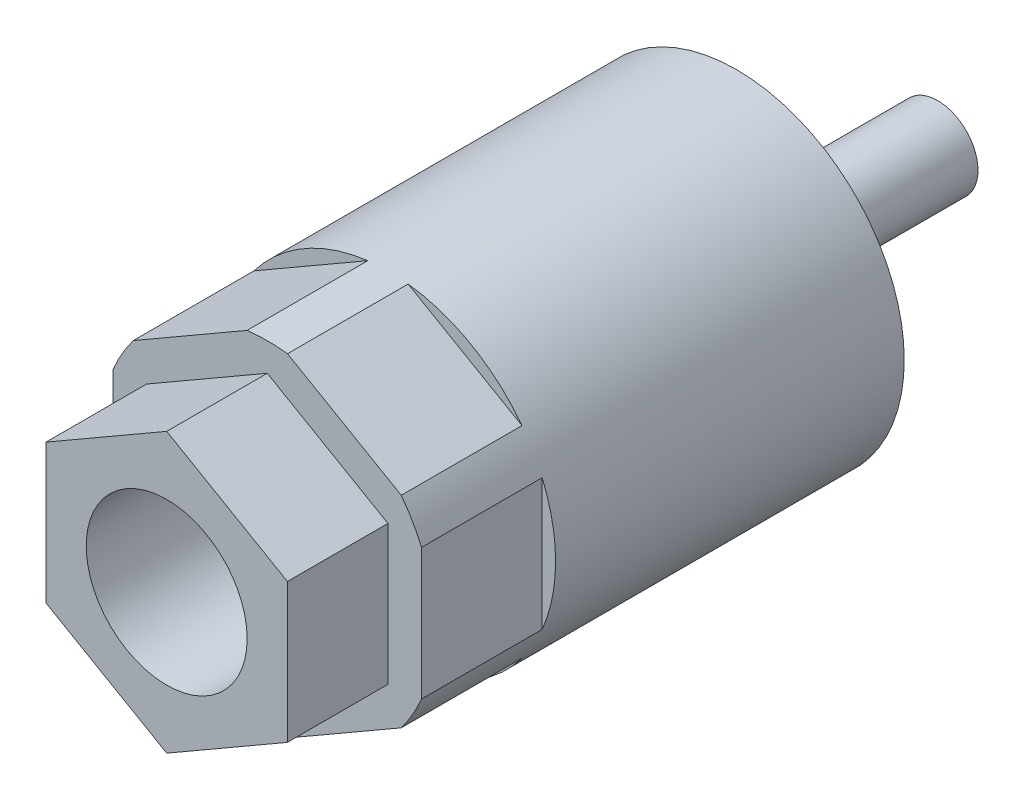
ISO-10303-21;
HEADER;
FILE_DESCRIPTION(('STEP AP214'),'2;1');
FILE_NAME('part.step','',(''),(''),'','','');
FILE_SCHEMA(('AUTOMOTIVE_DESIGN { 1 0 10303 214 1 1 1 1 }'));
ENDSEC;
DATA;
#1=APPLICATION_CONTEXT('core data for automotive mechanical design processes');
#2=APPLICATION_PROTOCOL_DEFINITION('international standard','automotive_design',2000,#1);
#3=PRODUCT_CONTEXT('',#1,'mechanical');
#4=PRODUCT('Part','Part','',(#3));
#5=PRODUCT_RELATED_PRODUCT_CATEGORY('part','',(#4));
#6=PRODUCT_DEFINITION_FORMATION('','',#4);
#7=PRODUCT_DEFINITION_CONTEXT('part definition',#1,'design');
#8=PRODUCT_DEFINITION('design','',#6,#7);
#9=PRODUCT_DEFINITION_SHAPE('','',#8);
#10=(LENGTH_UNIT() NAMED_UNIT(*) SI_UNIT(.MILLI.,.METRE.));
#11=(NAMED_UNIT(*) PLANE_ANGLE_UNIT() SI_UNIT($,.RADIAN.));
#12=(NAMED_UNIT(*) SI_UNIT($,.STERADIAN.) SOLID_ANGLE_UNIT());
#13=UNCERTAINTY_MEASURE_WITH_UNIT(LENGTH_MEASURE(1.E-05),#10,'distance_accuracy_value','');
#14=(GEOMETRIC_REPRESENTATION_CONTEXT(3) GLOBAL_UNCERTAINTY_ASSIGNED_CONTEXT((#13)) GLOBAL_UNIT_ASSIGNED_CONTEXT((#10,
#11,#12)) REPRESENTATION_CONTEXT('',''));
#15=CARTESIAN_POINT('',(0.,0.,0.));
#16=DIRECTION('',(0.,0.,1.));
#17=DIRECTION('',(1.,0.,0.));
#18=AXIS2_PLACEMENT_3D('',#15,#16,#17);
#19=CARTESIAN_POINT('',(0.,0.,80.));
#20=DIRECTION('',(0.,0.,1.));
#21=DIRECTION('',(1.,0.,0.));
#22=AXIS2_PLACEMENT_3D('',#19,#20,#21);
#23=CYLINDRICAL_SURFACE('',#22,25.);
#24=CARTESIAN_POINT('',(0.,0.,0.));
#25=DIRECTION('',(0.,0.,1.));
#26=DIRECTION('',(1.,0.,0.));
#27=AXIS2_PLACEMENT_3D('',#24,#25,#26);
#28=CIRCLE('',#27,25.);
#29=CARTESIAN_POINT('',(25.,0.,0.));
#30=VERTEX_POINT('',#29);
#31=EDGE_CURVE('E215',#30,#30,#28,.T.);
#32=ORIENTED_EDGE('',*,*,#31,.T.);
#33=EDGE_LOOP('',(#32));
#34=FACE_BOUND('',#33,.T.);
#35=DIRECTION('',(0.,0.,1.));
#36=VECTOR('',#35,1.);
#37=CARTESIAN_POINT('',(23.,-9.79795897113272,80.));
#38=LINE('',#37,#36);
#39=CARTESIAN_POINT('',(23.,-9.79795897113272,52.));
#40=VERTEX_POINT('',#39);
#41=CARTESIAN_POINT('',(23.,-9.79795897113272,70.));
#42=VERTEX_POINT('',#41);
#43=EDGE_CURVE('E271',#40,#42,#38,.T.);
#44=ORIENTED_EDGE('',*,*,#43,.T.);
#45=CARTESIAN_POINT('',(0.,0.,70.));
#46=DIRECTION('',(0.,0.,1.));
#47=DIRECTION('',(1.,0.,0.));
#48=AXIS2_PLACEMENT_3D('',#45,#46,#47);
#49=CIRCLE('',#48,25.);
#50=CARTESIAN_POINT('',(19.9852813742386,-15.0196048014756,70.));
#51=VERTEX_POINT('',#50);
#52=EDGE_CURVE('E205',#42,#51,#49,.F.);
#53=ORIENTED_EDGE('',*,*,#52,.T.);
#54=DIRECTION('',(0.,0.,1.));
#55=VECTOR('',#54,1.);
#56=CARTESIAN_POINT('',(19.9852813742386,-15.0196048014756,80.));
#57=LINE('',#56,#55);
#58=CARTESIAN_POINT('',(19.9852813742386,-15.0196048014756,52.));
#59=VERTEX_POINT('',#58);
#60=EDGE_CURVE('E265',#59,#51,#57,.T.);
#61=ORIENTED_EDGE('',*,*,#60,.F.);
#62=CARTESIAN_POINT('',(0.,0.,52.));
#63=DIRECTION('',(0.,0.,1.));
#64=DIRECTION('',(1.,0.,0.));
#65=AXIS2_PLACEMENT_3D('',#62,#63,#64);
#66=CIRCLE('',#65,25.);
#67=CARTESIAN_POINT('',(3.01471862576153,-24.8175637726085,52.));
#68=VERTEX_POINT('',#67);
#69=EDGE_CURVE('E268',#59,#68,#66,.F.);
#70=ORIENTED_EDGE('',*,*,#69,.T.);
#71=DIRECTION('',(0.,0.,1.));
#72=VECTOR('',#71,1.);
#73=CARTESIAN_POINT('',(3.01471862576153,-24.8175637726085,80.));
#74=LINE('',#73,#72);
#75=CARTESIAN_POINT('',(3.01471862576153,-24.8175637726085,70.));
#76=VERTEX_POINT('',#75);
#77=EDGE_CURVE('E269',#76,#68,#74,.F.);
#78=ORIENTED_EDGE('',*,*,#77,.F.);
#79=CARTESIAN_POINT('',(-3.01471862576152,-24.8175637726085,70.));
#80=VERTEX_POINT('',#79);
#81=EDGE_CURVE('E195',#76,#80,#49,.F.);
#82=ORIENTED_EDGE('',*,*,#81,.T.);
#83=DIRECTION('',(0.,0.,1.));
#84=VECTOR('',#83,1.);
#85=CARTESIAN_POINT('',(-3.01471862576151,-24.8175637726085,80.));
#86=LINE('',#85,#84);
#87=CARTESIAN_POINT('',(-3.01471862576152,-24.8175637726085,52.));
#88=VERTEX_POINT('',#87);
#89=EDGE_CURVE('E263',#80,#88,#86,.F.);
#90=ORIENTED_EDGE('',*,*,#89,.T.);
#91=CARTESIAN_POINT('',(-19.9852813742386,-15.0196048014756,52.));
#92=VERTEX_POINT('',#91);
#93=EDGE_CURVE('E262',#88,#92,#66,.F.);
#94=ORIENTED_EDGE('',*,*,#93,.T.);
#95=DIRECTION('',(0.,0.,1.));
#96=VECTOR('',#95,1.);
#97=CARTESIAN_POINT('',(-19.9852813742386,-15.0196048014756,80.));
#98=LINE('',#97,#96);
#99=CARTESIAN_POINT('',(-19.9852813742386,-15.0196048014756,70.));
#100=VERTEX_POINT('',#99);
#101=EDGE_CURVE('E259',#92,#100,#98,.T.);
#102=ORIENTED_EDGE('',*,*,#101,.T.);
#103=CARTESIAN_POINT('',(-23.,-9.79795897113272,70.));
#104=VERTEX_POINT('',#103);
#105=EDGE_CURVE('E207',#100,#104,#49,.F.);
#106=ORIENTED_EDGE('',*,*,#105,.T.);
#107=DIRECTION('',(0.,0.,1.));
#108=VECTOR('',#107,1.);
#109=CARTESIAN_POINT('',(-23.,-9.79795897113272,80.));
#110=LINE('',#109,#108);
#111=CARTESIAN_POINT('',(-23.,-9.79795897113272,52.));
#112=VERTEX_POINT('',#111);
#113=EDGE_CURVE('E254',#112,#104,#110,.T.);
#114=ORIENTED_EDGE('',*,*,#113,.F.);
#115=CARTESIAN_POINT('',(-23.,9.79795897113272,52.));
#116=VERTEX_POINT('',#115);
#117=EDGE_CURVE('E252',#112,#116,#66,.F.);
#118=ORIENTED_EDGE('',*,*,#117,.T.);
#119=DIRECTION('',(0.,0.,1.));
#120=VECTOR('',#119,1.);
#121=CARTESIAN_POINT('',(-23.,9.79795897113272,80.));
#122=LINE('',#121,#120);
#123=CARTESIAN_POINT('',(-23.,9.79795897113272,70.));
#124=VERTEX_POINT('',#123);
#125=EDGE_CURVE('E257',#124,#116,#122,.F.);
#126=ORIENTED_EDGE('',*,*,#125,.F.);
#127=CARTESIAN_POINT('',(-19.9852813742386,15.0196048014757,70.));
#128=VERTEX_POINT('',#127);
#129=EDGE_CURVE('E201',#124,#128,#49,.F.);
#130=ORIENTED_EDGE('',*,*,#129,.T.);
#131=DIRECTION('',(0.,0.,1.));
#132=VECTOR('',#131,1.);
#133=CARTESIAN_POINT('',(-19.9852813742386,15.0196048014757,80.));
#134=LINE('',#133,#132);
#135=CARTESIAN_POINT('',(-19.9852813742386,15.0196048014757,52.));
#136=VERTEX_POINT('',#135);
#137=EDGE_CURVE('E244',#136,#128,#134,.T.);
#138=ORIENTED_EDGE('',*,*,#137,.F.);
#139=CARTESIAN_POINT('',(-3.01471862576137,24.8175637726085,52.));
#140=VERTEX_POINT('',#139);
#141=EDGE_CURVE('E247',#136,#140,#66,.F.);
#142=ORIENTED_EDGE('',*,*,#141,.T.);
#143=DIRECTION('',(0.,0.,1.));
#144=VECTOR('',#143,1.);
#145=CARTESIAN_POINT('',(-3.01471862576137,24.8175637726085,80.));
#146=LINE('',#145,#144);
#147=CARTESIAN_POINT('',(-3.01471862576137,24.8175637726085,70.));
#148=VERTEX_POINT('',#147);
#149=EDGE_CURVE('E250',#148,#140,#146,.F.);
#150=ORIENTED_EDGE('',*,*,#149,.F.);
#151=CARTESIAN_POINT('',(3.01471862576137,24.8175637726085,70.));
#152=VERTEX_POINT('',#151);
#153=EDGE_CURVE('E194',#148,#152,#49,.F.);
#154=ORIENTED_EDGE('',*,*,#153,.T.);
#155=DIRECTION('',(0.,0.,1.));
#156=VECTOR('',#155,1.);
#157=CARTESIAN_POINT('',(3.01471862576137,24.8175637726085,80.));
#158=LINE('',#157,#156);
#159=CARTESIAN_POINT('',(3.01471862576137,24.8175637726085,52.));
#160=VERTEX_POINT('',#159);
#161=EDGE_CURVE('E22',#152,#160,#158,.F.);
#162=ORIENTED_EDGE('',*,*,#161,.T.);
#163=CARTESIAN_POINT('',(19.9852813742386,15.0196048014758,52.));
#164=VERTEX_POINT('',#163);
#165=EDGE_CURVE('E251',#160,#164,#66,.F.);
#166=ORIENTED_EDGE('',*,*,#165,.T.);
#167=DIRECTION('',(0.,0.,1.));
#168=VECTOR('',#167,1.);
#169=CARTESIAN_POINT('',(19.9852813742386,15.0196048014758,80.));
#170=LINE('',#169,#168);
#171=CARTESIAN_POINT('',(19.9852813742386,15.0196048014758,70.));
#172=VERTEX_POINT('',#171);
#173=EDGE_CURVE('E277',#164,#172,#170,.T.);
#174=ORIENTED_EDGE('',*,*,#173,.T.);
#175=CARTESIAN_POINT('',(23.,9.79795897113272,70.));
#176=VERTEX_POINT('',#175);
#177=EDGE_CURVE('E37',#172,#176,#49,.F.);
#178=ORIENTED_EDGE('',*,*,#177,.T.);
#179=DIRECTION('',(0.,0.,1.));
#180=VECTOR('',#179,1.);
#181=CARTESIAN_POINT('',(23.,9.79795897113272,80.));
#182=LINE('',#181,#180);
#183=CARTESIAN_POINT('',(23.,9.79795897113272,52.));
#184=VERTEX_POINT('',#183);
#185=EDGE_CURVE('E275',#176,#184,#182,.F.);
#186=ORIENTED_EDGE('',*,*,#185,.T.);
#187=EDGE_CURVE('E274',#184,#40,#66,.F.);
#188=ORIENTED_EDGE('',*,*,#187,.T.);
#189=EDGE_LOOP('',(#44,#53,#61,#70,#78,#82,#90,#94,#102,#106,#114,#118,#126,#130,#138,#142,#150,
#154,#162,#166,#174,#178,#186,#188));
#190=FACE_BOUND('',#189,.T.);
#191=ADVANCED_FACE('F14',(#34,#190),#23,.T.);
#192=CARTESIAN_POINT('',(-23.,13.2790561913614,52.));
#193=DIRECTION('',(0.5,-0.86602540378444,0.));
#194=DIRECTION('',(0.86602540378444,0.5,0.));
#195=AXIS2_PLACEMENT_3D('',#192,#193,#194);
#196=PLANE('',#195);
#197=DIRECTION('',(-0.86602540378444,-0.5,0.));
#198=VECTOR('',#197,1.);
#199=CARTESIAN_POINT('',(-23.,13.2790561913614,70.));
#200=LINE('',#199,#198);
#201=EDGE_CURVE('E199',#148,#128,#200,.T.);
#202=ORIENTED_EDGE('',*,*,#201,.F.);
#203=ORIENTED_EDGE('',*,*,#149,.T.);
#204=DIRECTION('',(0.86602540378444,0.5,0.));
#205=VECTOR('',#204,1.);
#206=CARTESIAN_POINT('',(-23.,13.2790561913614,52.));
#207=LINE('',#206,#205);
#208=EDGE_CURVE('E225',#136,#140,#207,.T.);
#209=ORIENTED_EDGE('',*,*,#208,.F.);
#210=ORIENTED_EDGE('',*,*,#137,.T.);
#211=EDGE_LOOP('',(#202,#203,#209,#210));
#212=FACE_BOUND('',#211,.T.);
#213=ADVANCED_FACE('F334',(#212),#196,.F.);
#214=CARTESIAN_POINT('',(-23.,-13.2790561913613,52.));
#215=DIRECTION('',(1.,0.,0.));
#216=DIRECTION('',(0.,0.,-1.));
#217=AXIS2_PLACEMENT_3D('',#214,#215,#216);
#218=PLANE('',#217);
#219=DIRECTION('',(0.,-1.,0.));
#220=VECTOR('',#219,1.);
#221=CARTESIAN_POINT('',(-23.,-13.2790561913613,70.));
#222=LINE('',#221,#220);
#223=EDGE_CURVE('E204',#124,#104,#222,.T.);
#224=ORIENTED_EDGE('',*,*,#223,.F.);
#225=ORIENTED_EDGE('',*,*,#125,.T.);
#226=DIRECTION('',(0.,1.,0.));
#227=VECTOR('',#226,1.);
#228=CARTESIAN_POINT('',(-23.,-13.2790561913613,52.));
#229=LINE('',#228,#227);
#230=EDGE_CURVE('E222',#112,#116,#229,.T.);
#231=ORIENTED_EDGE('',*,*,#230,.F.);
#232=ORIENTED_EDGE('',*,*,#113,.T.);
#233=EDGE_LOOP('',(#224,#225,#231,#232));
#234=FACE_BOUND('',#233,.T.);
#235=ADVANCED_FACE('F302',(#234),#218,.F.);
#236=CARTESIAN_POINT('',(-23.,-13.2790561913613,52.));
#237=DIRECTION('',(-0.5,-0.866025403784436,0.));
#238=DIRECTION('',(0.866025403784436,-0.5,0.));
#239=AXIS2_PLACEMENT_3D('',#236,#237,#238);
#240=PLANE('',#239);
#241=ORIENTED_EDGE('',*,*,#89,.F.);
#242=DIRECTION('',(-0.866025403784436,0.5,0.));
#243=VECTOR('',#242,1.);
#244=CARTESIAN_POINT('',(-23.,-13.2790561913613,70.));
#245=LINE('',#244,#243);
#246=EDGE_CURVE('E208',#80,#100,#245,.T.);
#247=ORIENTED_EDGE('',*,*,#246,.T.);
#248=ORIENTED_EDGE('',*,*,#101,.F.);
#249=DIRECTION('',(0.866025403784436,-0.5,0.));
#250=VECTOR('',#249,1.);
#251=CARTESIAN_POINT('',(-23.,-13.2790561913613,52.));
#252=LINE('',#251,#250);
#253=EDGE_CURVE('E219',#92,#88,#252,.T.);
#254=ORIENTED_EDGE('',*,*,#253,.T.);
#255=EDGE_LOOP('',(#241,#247,#248,#254));
#256=FACE_BOUND('',#255,.T.);
#257=ADVANCED_FACE('F489',(#256),#240,.T.);
#258=CARTESIAN_POINT('',(23.,-13.2790561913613,52.));
#259=DIRECTION('',(-0.5,0.866025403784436,0.));
#260=DIRECTION('',(-0.866025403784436,-0.5,0.));
#261=AXIS2_PLACEMENT_3D('',#258,#259,#260);
#262=PLANE('',#261);
#263=DIRECTION('',(0.866025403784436,0.5,0.));
#264=VECTOR('',#263,1.);
#265=CARTESIAN_POINT('',(23.,-13.2790561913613,70.));
#266=LINE('',#265,#264);
#267=EDGE_CURVE('E202',#76,#51,#266,.T.);
#268=ORIENTED_EDGE('',*,*,#267,.F.);
#269=ORIENTED_EDGE('',*,*,#77,.T.);
#270=DIRECTION('',(-0.866025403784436,-0.5,0.));
#271=VECTOR('',#270,1.);
#272=CARTESIAN_POINT('',(23.,-13.2790561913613,52.));
#273=LINE('',#272,#271);
#274=EDGE_CURVE('E216',#59,#68,#273,.T.);
#275=ORIENTED_EDGE('',*,*,#274,.F.);
#276=ORIENTED_EDGE('',*,*,#60,.T.);
#277=EDGE_LOOP('',(#268,#269,#275,#276));
#278=FACE_BOUND('',#277,.T.);
#279=ADVANCED_FACE('F480',(#278),#262,.F.);
#280=CARTESIAN_POINT('',(23.,-13.2790561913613,52.));
#281=DIRECTION('',(1.,0.,0.));
#282=DIRECTION('',(0.,0.,-1.));
#283=AXIS2_PLACEMENT_3D('',#280,#281,#282);
#284=PLANE('',#283);
#285=ORIENTED_EDGE('',*,*,#185,.F.);
#286=DIRECTION('',(0.,-1.,0.));
#287=VECTOR('',#286,1.);
#288=CARTESIAN_POINT('',(23.,-13.2790561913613,70.));
#289=LINE('',#288,#287);
#290=EDGE_CURVE('E196',#176,#42,#289,.T.);
#291=ORIENTED_EDGE('',*,*,#290,.T.);
#292=ORIENTED_EDGE('',*,*,#43,.F.);
#293=DIRECTION('',(0.,1.,0.));
#294=VECTOR('',#293,1.);
#295=CARTESIAN_POINT('',(23.,-13.2790561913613,52.));
#296=LINE('',#295,#294);
#297=EDGE_CURVE('E212',#40,#184,#296,.T.);
#298=ORIENTED_EDGE('',*,*,#297,.T.);
#299=EDGE_LOOP('',(#285,#291,#292,#298));
#300=FACE_BOUND('',#299,.T.);
#301=ADVANCED_FACE('F470',(#300),#284,.T.);
#302=CARTESIAN_POINT('',(23.,13.2790561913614,52.));
#303=DIRECTION('',(0.5,0.86602540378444,0.));
#304=DIRECTION('',(-0.86602540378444,0.5,0.));
#305=AXIS2_PLACEMENT_3D('',#302,#303,#304);
#306=PLANE('',#305);
#307=ORIENTED_EDGE('',*,*,#161,.F.);
#308=DIRECTION('',(0.86602540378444,-0.5,0.));
#309=VECTOR('',#308,1.);
#310=CARTESIAN_POINT('',(23.,13.2790561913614,70.));
#311=LINE('',#310,#309);
#312=EDGE_CURVE('E9',#152,#172,#311,.T.);
#313=ORIENTED_EDGE('',*,*,#312,.T.);
#314=ORIENTED_EDGE('',*,*,#173,.F.);
#315=DIRECTION('',(-0.86602540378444,0.5,0.));
#316=VECTOR('',#315,1.);
#317=CARTESIAN_POINT('',(23.,13.2790561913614,52.));
#318=LINE('',#317,#316);
#319=EDGE_CURVE('E211',#164,#160,#318,.T.);
#320=ORIENTED_EDGE('',*,*,#319,.T.);
#321=EDGE_LOOP('',(#307,#313,#314,#320));
#322=FACE_BOUND('',#321,.T.);
#323=ADVANCED_FACE('F311',(#322),#306,.T.);
#324=CARTESIAN_POINT('',(6.,0.,-30.));
#325=DIRECTION('',(0.,0.,-1.));
#326=DIRECTION('',(-1.,0.,0.));
#327=AXIS2_PLACEMENT_3D('',#324,#325,#326);
#328=PLANE('',#327);
#329=CARTESIAN_POINT('',(0.,0.,-30.));
#330=DIRECTION('',(0.,0.,1.));
#331=DIRECTION('',(1.,0.,0.));
#332=AXIS2_PLACEMENT_3D('',#329,#330,#331);
#333=CIRCLE('',#332,6.);
#334=CARTESIAN_POINT('',(6.,0.,-30.));
#335=VERTEX_POINT('',#334);
#336=EDGE_CURVE('E235',#335,#335,#333,.T.);
#337=ORIENTED_EDGE('',*,*,#336,.F.);
#338=EDGE_LOOP('',(#337));
#339=FACE_BOUND('',#338,.T.);
#340=ADVANCED_FACE('F349',(#339),#328,.T.);
#341=CARTESIAN_POINT('',(0.,0.,80.));
#342=DIRECTION('',(0.,0.,1.));
#343=DIRECTION('',(1.,0.,0.));
#344=AXIS2_PLACEMENT_3D('',#341,#342,#343);
#345=CYLINDRICAL_SURFACE('',#344,6.);
#346=ORIENTED_EDGE('',*,*,#336,.T.);
#347=EDGE_LOOP('',(#346));
#348=FACE_BOUND('',#347,.T.);
#349=CARTESIAN_POINT('',(0.,0.,0.));
#350=DIRECTION('',(0.,0.,1.));
#351=DIRECTION('',(1.,0.,0.));
#352=AXIS2_PLACEMENT_3D('',#349,#350,#351);
#353=CIRCLE('',#352,6.);
#354=CARTESIAN_POINT('',(6.,0.,0.));
#355=VERTEX_POINT('',#354);
#356=EDGE_CURVE('E232',#355,#355,#353,.T.);
#357=ORIENTED_EDGE('',*,*,#356,.F.);
#358=EDGE_LOOP('',(#357));
#359=FACE_BOUND('',#358,.T.);
#360=ADVANCED_FACE('F345',(#348,#359),#345,.T.);
#361=CARTESIAN_POINT('',(25.,0.,0.));
#362=DIRECTION('',(0.,0.,-1.));
#363=DIRECTION('',(-1.,0.,0.));
#364=AXIS2_PLACEMENT_3D('',#361,#362,#363);
#365=PLANE('',#364);
#366=ORIENTED_EDGE('',*,*,#356,.T.);
#367=EDGE_LOOP('',(#366));
#368=FACE_BOUND('',#367,.T.);
#369=ORIENTED_EDGE('',*,*,#31,.F.);
#370=EDGE_LOOP('',(#369));
#371=FACE_BOUND('',#370,.T.);
#372=ADVANCED_FACE('F331',(#368,#371),#365,.T.);
#373=CARTESIAN_POINT('',(0.,0.,52.));
#374=DIRECTION('',(0.,0.,1.));
#375=DIRECTION('',(1.,0.,0.));
#376=AXIS2_PLACEMENT_3D('',#373,#374,#375);
#377=PLANE('',#376);
#378=ORIENTED_EDGE('',*,*,#208,.T.);
#379=ORIENTED_EDGE('',*,*,#141,.F.);
#380=EDGE_LOOP('',(#378,#379));
#381=FACE_BOUND('',#380,.T.);
#382=ADVANCED_FACE('F318',(#381),#377,.T.);
#383=ORIENTED_EDGE('',*,*,#230,.T.);
#384=ORIENTED_EDGE('',*,*,#117,.F.);
#385=EDGE_LOOP('',(#383,#384));
#386=FACE_BOUND('',#385,.T.);
#387=ADVANCED_FACE('F299',(#386),#377,.T.);
#388=ORIENTED_EDGE('',*,*,#253,.F.);
#389=ORIENTED_EDGE('',*,*,#93,.F.);
#390=EDGE_LOOP('',(#388,#389));
#391=FACE_BOUND('',#390,.T.);
#392=ADVANCED_FACE('F444',(#391),#377,.T.);
#393=ORIENTED_EDGE('',*,*,#274,.T.);
#394=ORIENTED_EDGE('',*,*,#69,.F.);
#395=EDGE_LOOP('',(#393,#394));
#396=FACE_BOUND('',#395,.T.);
#397=ADVANCED_FACE('F326',(#396),#377,.T.);
#398=ORIENTED_EDGE('',*,*,#297,.F.);
#399=ORIENTED_EDGE('',*,*,#187,.F.);
#400=EDGE_LOOP('',(#398,#399));
#401=FACE_BOUND('',#400,.T.);
#402=ADVANCED_FACE('F316',(#401),#377,.T.);
#403=ORIENTED_EDGE('',*,*,#319,.F.);
#404=ORIENTED_EDGE('',*,*,#165,.F.);
#405=EDGE_LOOP('',(#403,#404));
#406=FACE_BOUND('',#405,.T.);
#407=ADVANCED_FACE('F314',(#406),#377,.T.);
#408=CARTESIAN_POINT('',(0.,0.,70.));
#409=DIRECTION('',(0.,0.,1.));
#410=DIRECTION('',(1.,0.,0.));
#411=AXIS2_PLACEMENT_3D('',#408,#409,#410);
#412=PLANE('',#411);
#413=ORIENTED_EDGE('',*,*,#81,.F.);
#414=ORIENTED_EDGE('',*,*,#267,.T.);
#415=ORIENTED_EDGE('',*,*,#52,.F.);
#416=ORIENTED_EDGE('',*,*,#290,.F.);
#417=ORIENTED_EDGE('',*,*,#177,.F.);
#418=ORIENTED_EDGE('',*,*,#312,.F.);
#419=ORIENTED_EDGE('',*,*,#153,.F.);
#420=ORIENTED_EDGE('',*,*,#201,.T.);
#421=ORIENTED_EDGE('',*,*,#129,.F.);
#422=ORIENTED_EDGE('',*,*,#223,.T.);
#423=ORIENTED_EDGE('',*,*,#105,.F.);
#424=ORIENTED_EDGE('',*,*,#246,.F.);
#425=EDGE_LOOP('',(#413,#414,#415,#416,#417,#418,#419,#420,#421,#422,#423,#424));
#426=FACE_BOUND('',#425,.T.);
#427=DIRECTION('',(-0.866025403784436,-0.5,0.));
#428=VECTOR('',#427,1.);
#429=CARTESIAN_POINT('',(18.,-10.3923048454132,70.));
#430=LINE('',#429,#428);
#431=CARTESIAN_POINT('',(18.,-10.3923048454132,70.));
#432=VERTEX_POINT('',#431);
#433=CARTESIAN_POINT('',(0.,-20.7846096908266,70.));
#434=VERTEX_POINT('',#433);
#435=EDGE_CURVE('E182',#432,#434,#430,.T.);
#436=ORIENTED_EDGE('',*,*,#435,.T.);
#437=DIRECTION('',(0.866025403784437,-0.5,0.));
#438=VECTOR('',#437,1.);
#439=CARTESIAN_POINT('',(-18.,-10.3923048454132,70.));
#440=LINE('',#439,#438);
#441=CARTESIAN_POINT('',(-18.,-10.3923048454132,70.));
#442=VERTEX_POINT('',#441);
#443=EDGE_CURVE('E146',#442,#434,#440,.T.);
#444=ORIENTED_EDGE('',*,*,#443,.F.);
#445=DIRECTION('',(0.,1.,0.));
#446=VECTOR('',#445,1.);
#447=CARTESIAN_POINT('',(-18.,-10.3923048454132,70.));
#448=LINE('',#447,#446);
#449=CARTESIAN_POINT('',(-18.,10.3923048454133,70.));
#450=VERTEX_POINT('',#449);
#451=EDGE_CURVE('E178',#442,#450,#448,.T.);
#452=ORIENTED_EDGE('',*,*,#451,.T.);
#453=DIRECTION('',(0.86602540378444,0.5,0.));
#454=VECTOR('',#453,1.);
#455=CARTESIAN_POINT('',(-18.,10.3923048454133,70.));
#456=LINE('',#455,#454);
#457=CARTESIAN_POINT('',(0.,20.7846096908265,70.));
#458=VERTEX_POINT('',#457);
#459=EDGE_CURVE('E175',#450,#458,#456,.T.);
#460=ORIENTED_EDGE('',*,*,#459,.T.);
#461=DIRECTION('',(-0.86602540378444,0.5,0.));
#462=VECTOR('',#461,1.);
#463=CARTESIAN_POINT('',(18.,10.3923048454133,70.));
#464=LINE('',#463,#462);
#465=CARTESIAN_POINT('',(18.,10.3923048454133,70.));
#466=VERTEX_POINT('',#465);
#467=EDGE_CURVE('E172',#466,#458,#464,.T.);
#468=ORIENTED_EDGE('',*,*,#467,.F.);
#469=DIRECTION('',(0.,1.,0.));
#470=VECTOR('',#469,1.);
#471=CARTESIAN_POINT('',(18.,-10.3923048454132,70.));
#472=LINE('',#471,#470);
#473=EDGE_CURVE('E169',#432,#466,#472,.T.);
#474=ORIENTED_EDGE('',*,*,#473,.F.);
#475=EDGE_LOOP('',(#436,#444,#452,#460,#468,#474));
#476=FACE_BOUND('',#475,.T.);
#477=ADVANCED_FACE('F303',(#426,#476),#412,.T.);
#478=CARTESIAN_POINT('',(18.,-10.3923048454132,70.));
#479=DIRECTION('',(-0.5,0.866025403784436,0.));
#480=DIRECTION('',(-0.866025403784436,-0.5,0.));
#481=AXIS2_PLACEMENT_3D('',#478,#479,#480);
#482=PLANE('',#481);
#483=DIRECTION('',(0.,0.,1.));
#484=VECTOR('',#483,1.);
#485=CARTESIAN_POINT('',(0.,-20.7846096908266,70.));
#486=LINE('',#485,#484);
#487=CARTESIAN_POINT('',(0.,-20.7846096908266,85.));
#488=VERTEX_POINT('',#487);
#489=EDGE_CURVE('E139',#434,#488,#486,.T.);
#490=ORIENTED_EDGE('',*,*,#489,.F.);
#491=ORIENTED_EDGE('',*,*,#435,.F.);
#492=DIRECTION('',(0.,0.,1.));
#493=VECTOR('',#492,1.);
#494=CARTESIAN_POINT('',(18.,-10.3923048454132,70.));
#495=LINE('',#494,#493);
#496=CARTESIAN_POINT('',(18.,-10.3923048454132,85.));
#497=VERTEX_POINT('',#496);
#498=EDGE_CURVE('E155',#432,#497,#495,.T.);
#499=ORIENTED_EDGE('',*,*,#498,.T.);
#500=DIRECTION('',(-0.866025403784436,-0.5,0.));
#501=VECTOR('',#500,1.);
#502=CARTESIAN_POINT('',(18.,-10.3923048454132,85.));
#503=LINE('',#502,#501);
#504=EDGE_CURVE('E153',#497,#488,#503,.T.);
#505=ORIENTED_EDGE('',*,*,#504,.T.);
#506=EDGE_LOOP('',(#490,#491,#499,#505));
#507=FACE_BOUND('',#506,.T.);
#508=ADVANCED_FACE('F154',(#507),#482,.F.);
#509=CARTESIAN_POINT('',(-18.,-10.3923048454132,70.));
#510=DIRECTION('',(-0.5,-0.866025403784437,0.));
#511=DIRECTION('',(0.866025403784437,-0.5,0.));
#512=AXIS2_PLACEMENT_3D('',#509,#510,#511);
#513=PLANE('',#512);
#514=DIRECTION('',(0.,0.,1.));
#515=VECTOR('',#514,1.);
#516=CARTESIAN_POINT('',(-18.,-10.3923048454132,70.));
#517=LINE('',#516,#515);
#518=CARTESIAN_POINT('',(-18.,-10.3923048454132,85.));
#519=VERTEX_POINT('',#518);
#520=EDGE_CURVE('E150',#442,#519,#517,.T.);
#521=ORIENTED_EDGE('',*,*,#520,.F.);
#522=ORIENTED_EDGE('',*,*,#443,.T.);
#523=ORIENTED_EDGE('',*,*,#489,.T.);
#524=DIRECTION('',(0.866025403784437,-0.5,0.));
#525=VECTOR('',#524,1.);
#526=CARTESIAN_POINT('',(-18.,-10.3923048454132,85.));
#527=LINE('',#526,#525);
#528=EDGE_CURVE('E143',#519,#488,#527,.T.);
#529=ORIENTED_EDGE('',*,*,#528,.F.);
#530=EDGE_LOOP('',(#521,#522,#523,#529));
#531=FACE_BOUND('',#530,.T.);
#532=ADVANCED_FACE('F141',(#531),#513,.T.);
#533=CARTESIAN_POINT('',(-18.,-10.3923048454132,70.));
#534=DIRECTION('',(1.,0.,0.));
#535=DIRECTION('',(0.,0.,-1.));
#536=AXIS2_PLACEMENT_3D('',#533,#534,#535);
#537=PLANE('',#536);
#538=DIRECTION('',(0.,0.,1.));
#539=VECTOR('',#538,1.);
#540=CARTESIAN_POINT('',(-18.,10.3923048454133,70.));
#541=LINE('',#540,#539);
#542=CARTESIAN_POINT('',(-18.,10.3923048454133,85.));
#543=VERTEX_POINT('',#542);
#544=EDGE_CURVE('E190',#450,#543,#541,.T.);
#545=ORIENTED_EDGE('',*,*,#544,.F.);
#546=ORIENTED_EDGE('',*,*,#451,.F.);
#547=ORIENTED_EDGE('',*,*,#520,.T.);
#548=DIRECTION('',(0.,1.,0.));
#549=VECTOR('',#548,1.);
#550=CARTESIAN_POINT('',(-18.,-10.3923048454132,85.));
#551=LINE('',#550,#549);
#552=EDGE_CURVE('E163',#519,#543,#551,.T.);
#553=ORIENTED_EDGE('',*,*,#552,.T.);
#554=EDGE_LOOP('',(#545,#546,#547,#553));
#555=FACE_BOUND('',#554,.T.);
#556=ADVANCED_FACE('F408',(#555),#537,.F.);
#557=CARTESIAN_POINT('',(-18.,10.3923048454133,70.));
#558=DIRECTION('',(0.5,-0.86602540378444,0.));
#559=DIRECTION('',(0.86602540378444,0.5,0.));
#560=AXIS2_PLACEMENT_3D('',#557,#558,#559);
#561=PLANE('',#560);
#562=DIRECTION('',(0.,0.,1.));
#563=VECTOR('',#562,1.);
#564=CARTESIAN_POINT('',(0.,20.7846096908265,70.));
#565=LINE('',#564,#563);
#566=CARTESIAN_POINT('',(0.,20.7846096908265,85.));
#567=VERTEX_POINT('',#566);
#568=EDGE_CURVE('E188',#458,#567,#565,.T.);
#569=ORIENTED_EDGE('',*,*,#568,.F.);
#570=ORIENTED_EDGE('',*,*,#459,.F.);
#571=ORIENTED_EDGE('',*,*,#544,.T.);
#572=DIRECTION('',(0.86602540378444,0.5,0.));
#573=VECTOR('',#572,1.);
#574=CARTESIAN_POINT('',(-18.,10.3923048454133,85.));
#575=LINE('',#574,#573);
#576=EDGE_CURVE('E165',#543,#567,#575,.T.);
#577=ORIENTED_EDGE('',*,*,#576,.T.);
#578=EDGE_LOOP('',(#569,#570,#571,#577));
#579=FACE_BOUND('',#578,.T.);
#580=ADVANCED_FACE('F399',(#579),#561,.F.);
#581=CARTESIAN_POINT('',(18.,10.3923048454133,70.));
#582=DIRECTION('',(0.5,0.86602540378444,0.));
#583=DIRECTION('',(-0.86602540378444,0.5,0.));
#584=AXIS2_PLACEMENT_3D('',#581,#582,#583);
#585=PLANE('',#584);
#586=DIRECTION('',(0.,0.,1.));
#587=VECTOR('',#586,1.);
#588=CARTESIAN_POINT('',(18.,10.3923048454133,70.));
#589=LINE('',#588,#587);
#590=CARTESIAN_POINT('',(18.,10.3923048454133,85.));
#591=VERTEX_POINT('',#590);
#592=EDGE_CURVE('E186',#466,#591,#589,.T.);
#593=ORIENTED_EDGE('',*,*,#592,.F.);
#594=ORIENTED_EDGE('',*,*,#467,.T.);
#595=ORIENTED_EDGE('',*,*,#568,.T.);
#596=DIRECTION('',(-0.86602540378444,0.5,0.));
#597=VECTOR('',#596,1.);
#598=CARTESIAN_POINT('',(18.,10.3923048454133,85.));
#599=LINE('',#598,#597);
#600=EDGE_CURVE('E29',#591,#567,#599,.T.);
#601=ORIENTED_EDGE('',*,*,#600,.F.);
#602=EDGE_LOOP('',(#593,#594,#595,#601));
#603=FACE_BOUND('',#602,.T.);
#604=ADVANCED_FACE('F388',(#603),#585,.T.);
#605=CARTESIAN_POINT('',(18.,-10.3923048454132,70.));
#606=DIRECTION('',(1.,0.,0.));
#607=DIRECTION('',(0.,0.,-1.));
#608=AXIS2_PLACEMENT_3D('',#605,#606,#607);
#609=PLANE('',#608);
#610=ORIENTED_EDGE('',*,*,#473,.T.);
#611=ORIENTED_EDGE('',*,*,#592,.T.);
#612=DIRECTION('',(0.,1.,0.));
#613=VECTOR('',#612,1.);
#614=CARTESIAN_POINT('',(18.,-10.3923048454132,85.));
#615=LINE('',#614,#613);
#616=EDGE_CURVE('E184',#497,#591,#615,.T.);
#617=ORIENTED_EDGE('',*,*,#616,.F.);
#618=ORIENTED_EDGE('',*,*,#498,.F.);
#619=EDGE_LOOP('',(#610,#611,#617,#618));
#620=FACE_BOUND('',#619,.T.);
#621=ADVANCED_FACE('F357',(#620),#609,.T.);
#622=CARTESIAN_POINT('',(12.,0.,8.));
#623=DIRECTION('',(0.,0.,-1.));
#624=DIRECTION('',(-1.,0.,0.));
#625=AXIS2_PLACEMENT_3D('',#622,#623,#624);
#626=PLANE('',#625);
#627=CARTESIAN_POINT('',(0.,0.,8.));
#628=DIRECTION('',(0.,0.,1.));
#629=DIRECTION('',(1.,0.,0.));
#630=AXIS2_PLACEMENT_3D('',#627,#628,#629);
#631=CIRCLE('',#630,12.);
#632=CARTESIAN_POINT('',(12.,0.,8.));
#633=VERTEX_POINT('',#632);
#634=EDGE_CURVE('E238',#633,#633,#631,.T.);
#635=ORIENTED_EDGE('',*,*,#634,.T.);
#636=EDGE_LOOP('',(#635));
#637=FACE_BOUND('',#636,.T.);
#638=ADVANCED_FACE('F354',(#637),#626,.F.);
#639=CARTESIAN_POINT('',(0.,0.,80.));
#640=DIRECTION('',(0.,0.,1.));
#641=DIRECTION('',(1.,0.,0.));
#642=AXIS2_PLACEMENT_3D('',#639,#640,#641);
#643=CYLINDRICAL_SURFACE('',#642,12.);
#644=ORIENTED_EDGE('',*,*,#634,.F.);
#645=EDGE_LOOP('',(#644));
#646=FACE_BOUND('',#645,.T.);
#647=CARTESIAN_POINT('',(0.,0.,85.));
#648=DIRECTION('',(0.,0.,1.));
#649=DIRECTION('',(1.,0.,0.));
#650=AXIS2_PLACEMENT_3D('',#647,#648,#649);
#651=CIRCLE('',#650,12.);
#652=CARTESIAN_POINT('',(12.,0.,85.));
#653=VERTEX_POINT('',#652);
#654=EDGE_CURVE('E241',#653,#653,#651,.T.);
#655=ORIENTED_EDGE('',*,*,#654,.T.);
#656=EDGE_LOOP('',(#655));
#657=FACE_BOUND('',#656,.T.);
#658=ADVANCED_FACE('F356',(#646,#657),#643,.F.);
#659=CARTESIAN_POINT('',(25.,0.,85.));
#660=DIRECTION('',(0.,0.,-1.));
#661=DIRECTION('',(-1.,0.,0.));
#662=AXIS2_PLACEMENT_3D('',#659,#660,#661);
#663=PLANE('',#662);
#664=ORIENTED_EDGE('',*,*,#528,.T.);
#665=ORIENTED_EDGE('',*,*,#504,.F.);
#666=ORIENTED_EDGE('',*,*,#616,.T.);
#667=ORIENTED_EDGE('',*,*,#600,.T.);
#668=ORIENTED_EDGE('',*,*,#576,.F.);
#669=ORIENTED_EDGE('',*,*,#552,.F.);
#670=EDGE_LOOP('',(#664,#665,#666,#667,#668,#669));
#671=FACE_BOUND('',#670,.T.);
#672=ORIENTED_EDGE('',*,*,#654,.F.);
#673=EDGE_LOOP('',(#672));
#674=FACE_BOUND('',#673,.T.);
#675=ADVANCED_FACE('F16',(#671,#674),#663,.F.);
#676=CLOSED_SHELL('',(#191,#213,#235,#257,#279,#301,#323,#340,#360,#372,#382,#387,#392,#397,
#402,#407,#477,#508,#532,#556,#580,#604,#621,#638,#658,#675));
#677=MANIFOLD_SOLID_BREP('B1',#676);
#678=ADVANCED_BREP_SHAPE_REPRESENTATION('',(#18,#677),#14);
#679=SHAPE_DEFINITION_REPRESENTATION(#9,#678);
ENDSEC;
END-ISO-10303-21;
